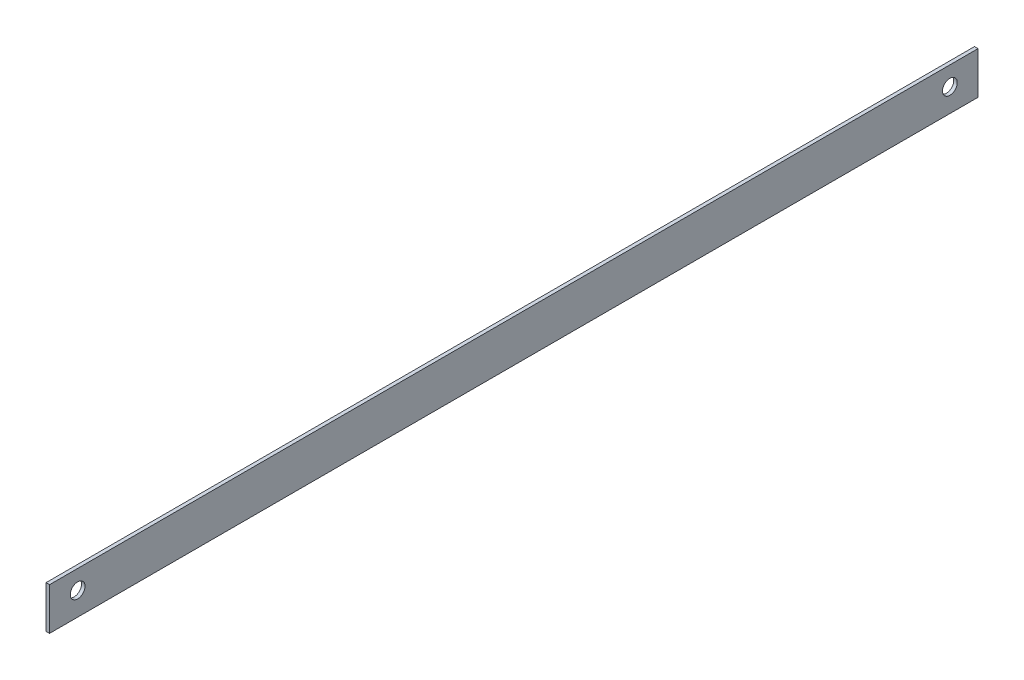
ISO-10303-21;
HEADER;
FILE_DESCRIPTION(('STEP AP214'),'2;1');
FILE_NAME('part.step','',(''),(''),'','','');
FILE_SCHEMA(('AUTOMOTIVE_DESIGN { 1 0 10303 214 1 1 1 1 }'));
ENDSEC;
DATA;
#1=APPLICATION_CONTEXT('core data for automotive mechanical design processes');
#2=APPLICATION_PROTOCOL_DEFINITION('international standard','automotive_design',2000,#1);
#3=PRODUCT_CONTEXT('',#1,'mechanical');
#4=PRODUCT('Part','Part','',(#3));
#5=PRODUCT_RELATED_PRODUCT_CATEGORY('part','',(#4));
#6=PRODUCT_DEFINITION_FORMATION('','',#4);
#7=PRODUCT_DEFINITION_CONTEXT('part definition',#1,'design');
#8=PRODUCT_DEFINITION('design','',#6,#7);
#9=PRODUCT_DEFINITION_SHAPE('','',#8);
#10=(LENGTH_UNIT() NAMED_UNIT(*) SI_UNIT(.MILLI.,.METRE.));
#11=(NAMED_UNIT(*) PLANE_ANGLE_UNIT() SI_UNIT($,.RADIAN.));
#12=(NAMED_UNIT(*) SI_UNIT($,.STERADIAN.) SOLID_ANGLE_UNIT());
#13=UNCERTAINTY_MEASURE_WITH_UNIT(LENGTH_MEASURE(1.E-05),#10,'distance_accuracy_value','');
#14=(GEOMETRIC_REPRESENTATION_CONTEXT(3) GLOBAL_UNCERTAINTY_ASSIGNED_CONTEXT((#13)) GLOBAL_UNIT_ASSIGNED_CONTEXT((#10,
#11,#12)) REPRESENTATION_CONTEXT('',''));
#15=CARTESIAN_POINT('',(0.,0.,0.));
#16=DIRECTION('',(0.,0.,1.));
#17=DIRECTION('',(1.,0.,0.));
#18=AXIS2_PLACEMENT_3D('',#15,#16,#17);
#19=CARTESIAN_POINT('',(2.5,0.,330.));
#20=DIRECTION('',(-1.,0.,0.));
#21=DIRECTION('',(0.,0.,1.));
#22=AXIS2_PLACEMENT_3D('',#19,#20,#21);
#23=PLANE('',#22);
#24=CARTESIAN_POINT('',(2.5,16.5,-310.));
#25=DIRECTION('',(1.,0.,0.));
#26=DIRECTION('',(0.,0.,-1.));
#27=AXIS2_PLACEMENT_3D('',#24,#25,#26);
#28=CIRCLE('',#27,5.25);
#29=CARTESIAN_POINT('',(2.5,16.5,-315.25));
#30=VERTEX_POINT('',#29);
#31=EDGE_CURVE('E160',#30,#30,#28,.T.);
#32=ORIENTED_EDGE('',*,*,#31,.F.);
#33=EDGE_LOOP('',(#32));
#34=FACE_BOUND('',#33,.T.);
#35=CARTESIAN_POINT('',(2.5,16.5,310.));
#36=DIRECTION('',(1.,0.,0.));
#37=DIRECTION('',(0.,0.,-1.));
#38=AXIS2_PLACEMENT_3D('',#35,#36,#37);
#39=CIRCLE('',#38,5.25);
#40=CARTESIAN_POINT('',(2.5,16.5,304.75));
#41=VERTEX_POINT('',#40);
#42=EDGE_CURVE('E108',#41,#41,#39,.T.);
#43=ORIENTED_EDGE('',*,*,#42,.F.);
#44=EDGE_LOOP('',(#43));
#45=FACE_BOUND('',#44,.T.);
#46=DIRECTION('',(0.,1.,0.));
#47=VECTOR('',#46,1.);
#48=CARTESIAN_POINT('',(2.5,0.,-330.));
#49=LINE('',#48,#47);
#50=CARTESIAN_POINT('',(2.5,0.,-330.));
#51=VERTEX_POINT('',#50);
#52=CARTESIAN_POINT('',(2.5,30.,-330.));
#53=VERTEX_POINT('',#52);
#54=EDGE_CURVE('E104',#51,#53,#49,.T.);
#55=ORIENTED_EDGE('',*,*,#54,.T.);
#56=DIRECTION('',(0.,0.,-1.));
#57=VECTOR('',#56,1.);
#58=CARTESIAN_POINT('',(2.5,30.,330.));
#59=LINE('',#58,#57);
#60=CARTESIAN_POINT('',(2.5,30.,330.));
#61=VERTEX_POINT('',#60);
#62=EDGE_CURVE('E11',#61,#53,#59,.T.);
#63=ORIENTED_EDGE('',*,*,#62,.F.);
#64=DIRECTION('',(0.,1.,0.));
#65=VECTOR('',#64,1.);
#66=CARTESIAN_POINT('',(2.5,0.,330.));
#67=LINE('',#66,#65);
#68=CARTESIAN_POINT('',(2.5,0.,330.));
#69=VERTEX_POINT('',#68);
#70=EDGE_CURVE('E123',#69,#61,#67,.T.);
#71=ORIENTED_EDGE('',*,*,#70,.F.);
#72=DIRECTION('',(0.,0.,-1.));
#73=VECTOR('',#72,1.);
#74=CARTESIAN_POINT('',(2.5,0.,330.));
#75=LINE('',#74,#73);
#76=EDGE_CURVE('E67',#69,#51,#75,.T.);
#77=ORIENTED_EDGE('',*,*,#76,.T.);
#78=EDGE_LOOP('',(#55,#63,#71,#77));
#79=FACE_BOUND('',#78,.T.);
#80=ADVANCED_FACE('F52',(#34,#45,#79),#23,.F.);
#81=CARTESIAN_POINT('',(0.,30.,330.));
#82=DIRECTION('',(0.,1.,0.));
#83=DIRECTION('',(0.,0.,1.));
#84=AXIS2_PLACEMENT_3D('',#81,#82,#83);
#85=PLANE('',#84);
#86=DIRECTION('',(1.,0.,0.));
#87=VECTOR('',#86,1.);
#88=CARTESIAN_POINT('',(0.,30.,-330.));
#89=LINE('',#88,#87);
#90=CARTESIAN_POINT('',(0.,30.,-330.));
#91=VERTEX_POINT('',#90);
#92=EDGE_CURVE('E98',#91,#53,#89,.T.);
#93=ORIENTED_EDGE('',*,*,#92,.F.);
#94=DIRECTION('',(0.,0.,-1.));
#95=VECTOR('',#94,1.);
#96=CARTESIAN_POINT('',(0.,30.,330.));
#97=LINE('',#96,#95);
#98=CARTESIAN_POINT('',(0.,30.,330.));
#99=VERTEX_POINT('',#98);
#100=EDGE_CURVE('E60',#99,#91,#97,.T.);
#101=ORIENTED_EDGE('',*,*,#100,.F.);
#102=DIRECTION('',(1.,0.,0.));
#103=VECTOR('',#102,1.);
#104=CARTESIAN_POINT('',(0.,30.,330.));
#105=LINE('',#104,#103);
#106=EDGE_CURVE('E101',#99,#61,#105,.T.);
#107=ORIENTED_EDGE('',*,*,#106,.T.);
#108=ORIENTED_EDGE('',*,*,#62,.T.);
#109=EDGE_LOOP('',(#93,#101,#107,#108));
#110=FACE_BOUND('',#109,.T.);
#111=ADVANCED_FACE('F96',(#110),#85,.T.);
#112=CARTESIAN_POINT('',(0.,0.,330.));
#113=DIRECTION('',(-1.,0.,0.));
#114=DIRECTION('',(0.,0.,1.));
#115=AXIS2_PLACEMENT_3D('',#112,#113,#114);
#116=PLANE('',#115);
#117=CARTESIAN_POINT('',(0.,16.5,-310.));
#118=DIRECTION('',(-1.,0.,0.));
#119=DIRECTION('',(0.,0.,1.));
#120=AXIS2_PLACEMENT_3D('',#117,#118,#119);
#121=CIRCLE('',#120,5.25);
#122=CARTESIAN_POINT('',(0.,16.5,-304.75));
#123=VERTEX_POINT('',#122);
#124=EDGE_CURVE('E169',#123,#123,#121,.F.);
#125=ORIENTED_EDGE('',*,*,#124,.T.);
#126=EDGE_LOOP('',(#125));
#127=FACE_BOUND('',#126,.T.);
#128=CARTESIAN_POINT('',(0.,16.5,310.));
#129=DIRECTION('',(-1.,0.,0.));
#130=DIRECTION('',(0.,0.,1.));
#131=AXIS2_PLACEMENT_3D('',#128,#129,#130);
#132=CIRCLE('',#131,5.25);
#133=CARTESIAN_POINT('',(0.,16.5,315.25));
#134=VERTEX_POINT('',#133);
#135=EDGE_CURVE('E164',#134,#134,#132,.F.);
#136=ORIENTED_EDGE('',*,*,#135,.T.);
#137=EDGE_LOOP('',(#136));
#138=FACE_BOUND('',#137,.T.);
#139=DIRECTION('',(0.,1.,0.));
#140=VECTOR('',#139,1.);
#141=CARTESIAN_POINT('',(0.,0.,-330.));
#142=LINE('',#141,#140);
#143=CARTESIAN_POINT('',(0.,0.,-330.));
#144=VERTEX_POINT('',#143);
#145=EDGE_CURVE('E111',#144,#91,#142,.T.);
#146=ORIENTED_EDGE('',*,*,#145,.F.);
#147=DIRECTION('',(0.,0.,-1.));
#148=VECTOR('',#147,1.);
#149=CARTESIAN_POINT('',(0.,0.,330.));
#150=LINE('',#149,#148);
#151=CARTESIAN_POINT('',(0.,0.,330.));
#152=VERTEX_POINT('',#151);
#153=EDGE_CURVE('E75',#152,#144,#150,.T.);
#154=ORIENTED_EDGE('',*,*,#153,.F.);
#155=DIRECTION('',(0.,1.,0.));
#156=VECTOR('',#155,1.);
#157=CARTESIAN_POINT('',(0.,0.,330.));
#158=LINE('',#157,#156);
#159=EDGE_CURVE('E128',#152,#99,#158,.T.);
#160=ORIENTED_EDGE('',*,*,#159,.T.);
#161=ORIENTED_EDGE('',*,*,#100,.T.);
#162=EDGE_LOOP('',(#146,#154,#160,#161));
#163=FACE_BOUND('',#162,.T.);
#164=ADVANCED_FACE('F138',(#127,#138,#163),#116,.T.);
#165=CARTESIAN_POINT('',(2.5,0.,330.));
#166=DIRECTION('',(0.,-1.,0.));
#167=DIRECTION('',(0.,0.,-1.));
#168=AXIS2_PLACEMENT_3D('',#165,#166,#167);
#169=PLANE('',#168);
#170=DIRECTION('',(-1.,0.,0.));
#171=VECTOR('',#170,1.);
#172=CARTESIAN_POINT('',(2.5,0.,-330.));
#173=LINE('',#172,#171);
#174=EDGE_CURVE('E117',#51,#144,#173,.T.);
#175=ORIENTED_EDGE('',*,*,#174,.F.);
#176=ORIENTED_EDGE('',*,*,#76,.F.);
#177=DIRECTION('',(-1.,0.,0.));
#178=VECTOR('',#177,1.);
#179=CARTESIAN_POINT('',(2.5,0.,330.));
#180=LINE('',#179,#178);
#181=EDGE_CURVE('E131',#69,#152,#180,.T.);
#182=ORIENTED_EDGE('',*,*,#181,.T.);
#183=ORIENTED_EDGE('',*,*,#153,.T.);
#184=EDGE_LOOP('',(#175,#176,#182,#183));
#185=FACE_BOUND('',#184,.T.);
#186=ADVANCED_FACE('F142',(#185),#169,.T.);
#187=CARTESIAN_POINT('',(2.5,30.,330.));
#188=DIRECTION('',(0.,0.,-1.));
#189=DIRECTION('',(-1.,0.,0.));
#190=AXIS2_PLACEMENT_3D('',#187,#188,#189);
#191=PLANE('',#190);
#192=ORIENTED_EDGE('',*,*,#70,.T.);
#193=ORIENTED_EDGE('',*,*,#106,.F.);
#194=ORIENTED_EDGE('',*,*,#159,.F.);
#195=ORIENTED_EDGE('',*,*,#181,.F.);
#196=EDGE_LOOP('',(#192,#193,#194,#195));
#197=FACE_BOUND('',#196,.T.);
#198=ADVANCED_FACE('F140',(#197),#191,.F.);
#199=CARTESIAN_POINT('',(2.5,30.,-330.));
#200=DIRECTION('',(0.,0.,-1.));
#201=DIRECTION('',(-1.,0.,0.));
#202=AXIS2_PLACEMENT_3D('',#199,#200,#201);
#203=PLANE('',#202);
#204=ORIENTED_EDGE('',*,*,#54,.F.);
#205=ORIENTED_EDGE('',*,*,#174,.T.);
#206=ORIENTED_EDGE('',*,*,#145,.T.);
#207=ORIENTED_EDGE('',*,*,#92,.T.);
#208=EDGE_LOOP('',(#204,#205,#206,#207));
#209=FACE_BOUND('',#208,.T.);
#210=ADVANCED_FACE('F110',(#209),#203,.T.);
#211=CARTESIAN_POINT('',(-0.00100000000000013,16.5,310.));
#212=DIRECTION('',(1.,0.,0.));
#213=DIRECTION('',(0.,0.,-1.));
#214=AXIS2_PLACEMENT_3D('',#211,#212,#213);
#215=CYLINDRICAL_SURFACE('',#214,5.25);
#216=ORIENTED_EDGE('',*,*,#135,.F.);
#217=EDGE_LOOP('',(#216));
#218=FACE_BOUND('',#217,.T.);
#219=ORIENTED_EDGE('',*,*,#42,.T.);
#220=EDGE_LOOP('',(#219));
#221=FACE_BOUND('',#220,.T.);
#222=ADVANCED_FACE('F176',(#218,#221),#215,.F.);
#223=CARTESIAN_POINT('',(-0.00100000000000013,16.5,-310.));
#224=DIRECTION('',(1.,0.,0.));
#225=DIRECTION('',(0.,0.,-1.));
#226=AXIS2_PLACEMENT_3D('',#223,#224,#225);
#227=CYLINDRICAL_SURFACE('',#226,5.25);
#228=ORIENTED_EDGE('',*,*,#124,.F.);
#229=EDGE_LOOP('',(#228));
#230=FACE_BOUND('',#229,.T.);
#231=ORIENTED_EDGE('',*,*,#31,.T.);
#232=EDGE_LOOP('',(#231));
#233=FACE_BOUND('',#232,.T.);
#234=ADVANCED_FACE('F174',(#230,#233),#227,.F.);
#235=CLOSED_SHELL('',(#80,#111,#164,#186,#198,#210,#222,#234));
#236=MANIFOLD_SOLID_BREP('B2',#235);
#237=ADVANCED_BREP_SHAPE_REPRESENTATION('',(#18,#236),#14);
#238=SHAPE_DEFINITION_REPRESENTATION(#9,#237);
ENDSEC;
END-ISO-10303-21;
